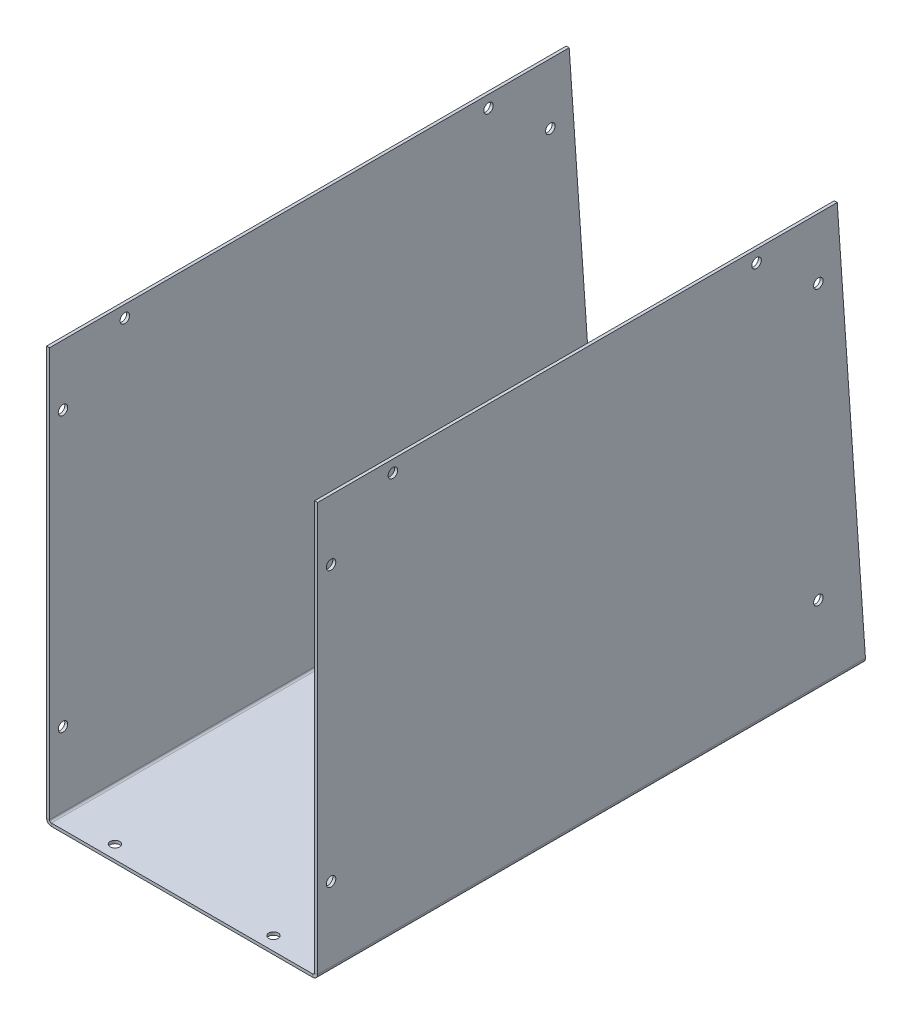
ISO-10303-21;
HEADER;
FILE_DESCRIPTION(('STEP AP214'),'2;1');
FILE_NAME('part.step','',(''),(''),'','','');
FILE_SCHEMA(('AUTOMOTIVE_DESIGN { 1 0 10303 214 1 1 1 1 }'));
ENDSEC;
DATA;
#1=APPLICATION_CONTEXT('core data for automotive mechanical design processes');
#2=APPLICATION_PROTOCOL_DEFINITION('international standard','automotive_design',2000,#1);
#3=PRODUCT_CONTEXT('',#1,'mechanical');
#4=PRODUCT('Part','Part','',(#3));
#5=PRODUCT_RELATED_PRODUCT_CATEGORY('part','',(#4));
#6=PRODUCT_DEFINITION_FORMATION('','',#4);
#7=PRODUCT_DEFINITION_CONTEXT('part definition',#1,'design');
#8=PRODUCT_DEFINITION('design','',#6,#7);
#9=PRODUCT_DEFINITION_SHAPE('','',#8);
#10=(LENGTH_UNIT() NAMED_UNIT(*) SI_UNIT(.MILLI.,.METRE.));
#11=(NAMED_UNIT(*) PLANE_ANGLE_UNIT() SI_UNIT($,.RADIAN.));
#12=(NAMED_UNIT(*) SI_UNIT($,.STERADIAN.) SOLID_ANGLE_UNIT());
#13=UNCERTAINTY_MEASURE_WITH_UNIT(LENGTH_MEASURE(1.E-05),#10,'distance_accuracy_value','');
#14=(GEOMETRIC_REPRESENTATION_CONTEXT(3) GLOBAL_UNCERTAINTY_ASSIGNED_CONTEXT((#13)) GLOBAL_UNIT_ASSIGNED_CONTEXT((#10,
#11,#12)) REPRESENTATION_CONTEXT('',''));
#15=CARTESIAN_POINT('',(0.,0.,0.));
#16=DIRECTION('',(0.,0.,1.));
#17=DIRECTION('',(1.,0.,0.));
#18=AXIS2_PLACEMENT_3D('',#15,#16,#17);
#19=CARTESIAN_POINT('',(-70.8025,0.,292.862));
#20=DIRECTION('',(-1.,0.,0.));
#21=DIRECTION('',(0.,0.,1.));
#22=AXIS2_PLACEMENT_3D('',#19,#20,#21);
#23=PLANE('',#22);
#24=CARTESIAN_POINT('',(-70.8025,42.0448840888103,25.3204999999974));
#25=DIRECTION('',(-1.,0.,0.));
#26=DIRECTION('',(0.,0.,1.));
#27=AXIS2_PLACEMENT_3D('',#24,#25,#26);
#28=CIRCLE('',#27,2.53999999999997);
#29=CARTESIAN_POINT('',(-70.8025,42.0448840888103,27.8604999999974));
#30=VERTEX_POINT('',#29);
#31=EDGE_CURVE('E214',#30,#30,#28,.T.);
#32=ORIENTED_EDGE('',*,*,#31,.T.);
#33=EDGE_LOOP('',(#32));
#34=FACE_BOUND('',#33,.T.);
#35=CARTESIAN_POINT('',(-70.8025,188.60288408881,25.3204999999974));
#36=DIRECTION('',(-1.,0.,0.));
#37=DIRECTION('',(0.,0.,1.));
#38=AXIS2_PLACEMENT_3D('',#35,#36,#37);
#39=CIRCLE('',#38,2.53999999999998);
#40=CARTESIAN_POINT('',(-70.8025,188.60288408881,27.8604999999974));
#41=VERTEX_POINT('',#40);
#42=EDGE_CURVE('E209',#41,#41,#39,.T.);
#43=ORIENTED_EDGE('',*,*,#42,.T.);
#44=EDGE_LOOP('',(#43));
#45=FACE_BOUND('',#44,.T.);
#46=CARTESIAN_POINT('',(-70.8025,214.566499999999,58.3562681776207));
#47=DIRECTION('',(-1.,0.,0.));
#48=DIRECTION('',(0.,0.,1.));
#49=AXIS2_PLACEMENT_3D('',#46,#47,#48);
#50=CIRCLE('',#49,2.53999999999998);
#51=CARTESIAN_POINT('',(-70.8025,214.566499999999,60.8962681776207));
#52=VERTEX_POINT('',#51);
#53=EDGE_CURVE('E204',#52,#52,#50,.T.);
#54=ORIENTED_EDGE('',*,*,#53,.T.);
#55=EDGE_LOOP('',(#54));
#56=FACE_BOUND('',#55,.T.);
#57=CARTESIAN_POINT('',(-70.8025,214.566499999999,252.634731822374));
#58=DIRECTION('',(-1.,0.,0.));
#59=DIRECTION('',(0.,0.,1.));
#60=AXIS2_PLACEMENT_3D('',#57,#58,#59);
#61=CIRCLE('',#60,2.54000000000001);
#62=CARTESIAN_POINT('',(-70.8025,214.566499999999,255.174731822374));
#63=VERTEX_POINT('',#62);
#64=EDGE_CURVE('E199',#63,#63,#61,.T.);
#65=ORIENTED_EDGE('',*,*,#64,.T.);
#66=EDGE_LOOP('',(#65));
#67=FACE_BOUND('',#66,.T.);
#68=CARTESIAN_POINT('',(-70.8025,188.60288408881,285.670499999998));
#69=DIRECTION('',(-1.,0.,0.));
#70=DIRECTION('',(0.,0.,1.));
#71=AXIS2_PLACEMENT_3D('',#68,#69,#70);
#72=CIRCLE('',#71,2.54000000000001);
#73=CARTESIAN_POINT('',(-70.8025,188.60288408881,288.210499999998));
#74=VERTEX_POINT('',#73);
#75=EDGE_CURVE('E194',#74,#74,#72,.T.);
#76=ORIENTED_EDGE('',*,*,#75,.T.);
#77=EDGE_LOOP('',(#76));
#78=FACE_BOUND('',#77,.T.);
#79=CARTESIAN_POINT('',(-70.8025,42.0448840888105,285.670499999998));
#80=DIRECTION('',(-1.,0.,0.));
#81=DIRECTION('',(0.,0.,1.));
#82=AXIS2_PLACEMENT_3D('',#79,#80,#81);
#83=CIRCLE('',#82,2.54);
#84=CARTESIAN_POINT('',(-70.8025,42.0448840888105,288.210499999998));
#85=VERTEX_POINT('',#84);
#86=EDGE_CURVE('E189',#85,#85,#83,.T.);
#87=ORIENTED_EDGE('',*,*,#86,.T.);
#88=EDGE_LOOP('',(#87));
#89=FACE_BOUND('',#88,.T.);
#90=DIRECTION('',(0.,0.997630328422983,0.0688020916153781));
#91=VECTOR('',#90,1.);
#92=CARTESIAN_POINT('',(-70.8025,20.1017704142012,1.38632899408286));
#93=LINE('',#92,#91);
#94=CARTESIAN_POINT('',(-70.8025,2.5875,0.178448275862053));
#95=VERTEX_POINT('',#94);
#96=CARTESIAN_POINT('',(-70.8025,220.98,15.24));
#97=VERTEX_POINT('',#96);
#98=EDGE_CURVE('E285',#95,#97,#93,.T.);
#99=ORIENTED_EDGE('',*,*,#98,.T.);
#100=DIRECTION('',(0.,0.,-1.));
#101=VECTOR('',#100,1.);
#102=CARTESIAN_POINT('',(-70.8025,220.98,292.862));
#103=LINE('',#102,#101);
#104=CARTESIAN_POINT('',(-70.8025,220.98,292.862));
#105=VERTEX_POINT('',#104);
#106=EDGE_CURVE('E179',#105,#97,#103,.T.);
#107=ORIENTED_EDGE('',*,*,#106,.F.);
#108=DIRECTION('',(0.,1.,0.));
#109=VECTOR('',#108,1.);
#110=CARTESIAN_POINT('',(-70.8025,0.,292.862));
#111=LINE('',#110,#109);
#112=CARTESIAN_POINT('',(-70.8025,2.5875,292.862));
#113=VERTEX_POINT('',#112);
#114=EDGE_CURVE('E305',#113,#105,#111,.T.);
#115=ORIENTED_EDGE('',*,*,#114,.F.);
#116=DIRECTION('',(0.,0.,-1.));
#117=VECTOR('',#116,1.);
#118=CARTESIAN_POINT('',(-70.8025,2.5875,292.862));
#119=LINE('',#118,#117);
#120=EDGE_CURVE('E338',#113,#95,#119,.T.);
#121=ORIENTED_EDGE('',*,*,#120,.T.);
#122=EDGE_LOOP('',(#99,#107,#115,#121));
#123=FACE_BOUND('',#122,.T.);
#124=ADVANCED_FACE('F37',(#34,#45,#56,#67,#78,#89,#123),#23,.F.);
#125=CARTESIAN_POINT('',(-72.39,220.98,292.862));
#126=DIRECTION('',(0.,1.,0.));
#127=DIRECTION('',(0.,0.,1.));
#128=AXIS2_PLACEMENT_3D('',#125,#126,#127);
#129=PLANE('',#128);
#130=ORIENTED_EDGE('',*,*,#106,.T.);
#131=DIRECTION('',(1.,0.,0.));
#132=VECTOR('',#131,1.);
#133=CARTESIAN_POINT('',(-70.8025,220.98,15.24));
#134=LINE('',#133,#132);
#135=CARTESIAN_POINT('',(-72.39,220.98,15.24));
#136=VERTEX_POINT('',#135);
#137=EDGE_CURVE('E292',#97,#136,#134,.F.);
#138=ORIENTED_EDGE('',*,*,#137,.T.);
#139=DIRECTION('',(0.,0.,-1.));
#140=VECTOR('',#139,1.);
#141=CARTESIAN_POINT('',(-72.39,220.98,292.862));
#142=LINE('',#141,#140);
#143=CARTESIAN_POINT('',(-72.39,220.98,292.862));
#144=VERTEX_POINT('',#143);
#145=EDGE_CURVE('E176',#144,#136,#142,.T.);
#146=ORIENTED_EDGE('',*,*,#145,.F.);
#147=DIRECTION('',(1.,0.,0.));
#148=VECTOR('',#147,1.);
#149=CARTESIAN_POINT('',(-72.39,220.98,292.862));
#150=LINE('',#149,#148);
#151=EDGE_CURVE('E309',#144,#105,#150,.T.);
#152=ORIENTED_EDGE('',*,*,#151,.T.);
#153=EDGE_LOOP('',(#130,#138,#146,#152));
#154=FACE_BOUND('',#153,.T.);
#155=ADVANCED_FACE('F388',(#154),#129,.T.);
#156=CARTESIAN_POINT('',(-72.39,0.,292.862));
#157=DIRECTION('',(-1.,0.,0.));
#158=DIRECTION('',(0.,0.,1.));
#159=AXIS2_PLACEMENT_3D('',#156,#157,#158);
#160=PLANE('',#159);
#161=CARTESIAN_POINT('',(-72.39,42.0448840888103,25.3204999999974));
#162=DIRECTION('',(1.,0.,0.));
#163=DIRECTION('',(0.,0.,-1.));
#164=AXIS2_PLACEMENT_3D('',#161,#162,#163);
#165=CIRCLE('',#164,2.53999999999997);
#166=CARTESIAN_POINT('',(-72.39,42.0448840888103,22.7804999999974));
#167=VERTEX_POINT('',#166);
#168=EDGE_CURVE('E215',#167,#167,#165,.T.);
#169=ORIENTED_EDGE('',*,*,#168,.T.);
#170=EDGE_LOOP('',(#169));
#171=FACE_BOUND('',#170,.T.);
#172=CARTESIAN_POINT('',(-72.39,188.60288408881,25.3204999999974));
#173=DIRECTION('',(1.,0.,0.));
#174=DIRECTION('',(0.,0.,-1.));
#175=AXIS2_PLACEMENT_3D('',#172,#173,#174);
#176=CIRCLE('',#175,2.53999999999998);
#177=CARTESIAN_POINT('',(-72.39,188.60288408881,22.7804999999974));
#178=VERTEX_POINT('',#177);
#179=EDGE_CURVE('E210',#178,#178,#176,.T.);
#180=ORIENTED_EDGE('',*,*,#179,.T.);
#181=EDGE_LOOP('',(#180));
#182=FACE_BOUND('',#181,.T.);
#183=CARTESIAN_POINT('',(-72.39,214.566499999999,58.3562681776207));
#184=DIRECTION('',(1.,0.,0.));
#185=DIRECTION('',(0.,0.,-1.));
#186=AXIS2_PLACEMENT_3D('',#183,#184,#185);
#187=CIRCLE('',#186,2.53999999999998);
#188=CARTESIAN_POINT('',(-72.39,214.566499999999,55.8162681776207));
#189=VERTEX_POINT('',#188);
#190=EDGE_CURVE('E205',#189,#189,#187,.T.);
#191=ORIENTED_EDGE('',*,*,#190,.T.);
#192=EDGE_LOOP('',(#191));
#193=FACE_BOUND('',#192,.T.);
#194=CARTESIAN_POINT('',(-72.39,214.566499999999,252.634731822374));
#195=DIRECTION('',(1.,0.,0.));
#196=DIRECTION('',(0.,0.,-1.));
#197=AXIS2_PLACEMENT_3D('',#194,#195,#196);
#198=CIRCLE('',#197,2.54000000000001);
#199=CARTESIAN_POINT('',(-72.39,214.566499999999,250.094731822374));
#200=VERTEX_POINT('',#199);
#201=EDGE_CURVE('E200',#200,#200,#198,.T.);
#202=ORIENTED_EDGE('',*,*,#201,.T.);
#203=EDGE_LOOP('',(#202));
#204=FACE_BOUND('',#203,.T.);
#205=CARTESIAN_POINT('',(-72.39,188.60288408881,285.670499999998));
#206=DIRECTION('',(1.,0.,0.));
#207=DIRECTION('',(0.,0.,-1.));
#208=AXIS2_PLACEMENT_3D('',#205,#206,#207);
#209=CIRCLE('',#208,2.54000000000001);
#210=CARTESIAN_POINT('',(-72.39,188.60288408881,283.130499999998));
#211=VERTEX_POINT('',#210);
#212=EDGE_CURVE('E195',#211,#211,#209,.T.);
#213=ORIENTED_EDGE('',*,*,#212,.T.);
#214=EDGE_LOOP('',(#213));
#215=FACE_BOUND('',#214,.T.);
#216=CARTESIAN_POINT('',(-72.39,42.0448840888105,285.670499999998));
#217=DIRECTION('',(1.,0.,0.));
#218=DIRECTION('',(0.,0.,-1.));
#219=AXIS2_PLACEMENT_3D('',#216,#217,#218);
#220=CIRCLE('',#219,2.54);
#221=CARTESIAN_POINT('',(-72.39,42.0448840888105,283.130499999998));
#222=VERTEX_POINT('',#221);
#223=EDGE_CURVE('E190',#222,#222,#220,.T.);
#224=ORIENTED_EDGE('',*,*,#223,.T.);
#225=EDGE_LOOP('',(#224));
#226=FACE_BOUND('',#225,.T.);
#227=ORIENTED_EDGE('',*,*,#145,.T.);
#228=DIRECTION('',(0.,0.997630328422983,0.0688020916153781));
#229=VECTOR('',#228,1.);
#230=CARTESIAN_POINT('',(-72.39,20.1017704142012,1.38632899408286));
#231=LINE('',#230,#229);
#232=CARTESIAN_POINT('',(-72.39,2.5875,0.178448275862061));
#233=VERTEX_POINT('',#232);
#234=EDGE_CURVE('E288',#233,#136,#231,.T.);
#235=ORIENTED_EDGE('',*,*,#234,.F.);
#236=DIRECTION('',(0.,0.,-1.));
#237=VECTOR('',#236,1.);
#238=CARTESIAN_POINT('',(-72.39,2.5875,292.862));
#239=LINE('',#238,#237);
#240=CARTESIAN_POINT('',(-72.39,2.5875,292.862));
#241=VERTEX_POINT('',#240);
#242=EDGE_CURVE('E168',#241,#233,#239,.T.);
#243=ORIENTED_EDGE('',*,*,#242,.F.);
#244=DIRECTION('',(0.,1.,0.));
#245=VECTOR('',#244,1.);
#246=CARTESIAN_POINT('',(-72.39,0.,292.862));
#247=LINE('',#246,#245);
#248=EDGE_CURVE('E312',#241,#144,#247,.T.);
#249=ORIENTED_EDGE('',*,*,#248,.T.);
#250=EDGE_LOOP('',(#227,#235,#243,#249));
#251=FACE_BOUND('',#250,.T.);
#252=ADVANCED_FACE('F382',(#171,#182,#193,#204,#215,#226,#251),#160,.T.);
#253=CARTESIAN_POINT('',(-69.8025,2.5875,292.862));
#254=DIRECTION('',(0.,0.,-1.));
#255=DIRECTION('',(-1.,0.,0.));
#256=AXIS2_PLACEMENT_3D('',#253,#254,#255);
#257=CYLINDRICAL_SURFACE('',#256,2.5875);
#258=ORIENTED_EDGE('',*,*,#242,.T.);
#259=CARTESIAN_POINT('',(-69.8025,2.5875,0.178448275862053));
#260=DIRECTION('',(0.,-0.0266438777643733,0.999644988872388));
#261=DIRECTION('',(0.,-0.999644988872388,-0.0266438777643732));
#262=AXIS2_PLACEMENT_3D('',#259,#260,#261);
#263=ELLIPSE('',#262,2.58841891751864,2.5875);
#264=CARTESIAN_POINT('',(-69.8025,0.,0.109482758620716));
#265=VERTEX_POINT('',#264);
#266=EDGE_CURVE('E283',#265,#233,#263,.F.);
#267=ORIENTED_EDGE('',*,*,#266,.F.);
#268=DIRECTION('',(0.,0.,-1.));
#269=VECTOR('',#268,1.);
#270=CARTESIAN_POINT('',(-69.8025,0.,292.862));
#271=LINE('',#270,#269);
#272=CARTESIAN_POINT('',(-69.8025,0.,292.862));
#273=VERTEX_POINT('',#272);
#274=EDGE_CURVE('E160',#273,#265,#271,.T.);
#275=ORIENTED_EDGE('',*,*,#274,.F.);
#276=CARTESIAN_POINT('',(-69.8025,2.5875,292.862));
#277=DIRECTION('',(0.,0.,1.));
#278=DIRECTION('',(1.,0.,0.));
#279=AXIS2_PLACEMENT_3D('',#276,#277,#278);
#280=CIRCLE('',#279,2.5875);
#281=EDGE_CURVE('E315',#273,#241,#280,.F.);
#282=ORIENTED_EDGE('',*,*,#281,.T.);
#283=EDGE_LOOP('',(#258,#267,#275,#282));
#284=FACE_BOUND('',#283,.T.);
#285=ADVANCED_FACE('F375',(#284),#257,.T.);
#286=CARTESIAN_POINT('',(-72.39,0.,292.862));
#287=DIRECTION('',(0.,-1.,0.));
#288=DIRECTION('',(1.,0.,0.));
#289=AXIS2_PLACEMENT_3D('',#286,#287,#288);
#290=PLANE('',#289);
#291=CARTESIAN_POINT('',(41.6481159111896,1.18672937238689E-13,285.670499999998));
#292=DIRECTION('',(0.,-1.,0.));
#293=DIRECTION('',(1.,0.,0.));
#294=AXIS2_PLACEMENT_3D('',#291,#292,#293);
#295=CIRCLE('',#294,2.53999999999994);
#296=CARTESIAN_POINT('',(44.1881159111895,1.19139527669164E-13,285.670499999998));
#297=VERTEX_POINT('',#296);
#298=EDGE_CURVE('E236',#297,#297,#295,.T.);
#299=ORIENTED_EDGE('',*,*,#298,.F.);
#300=EDGE_LOOP('',(#299));
#301=FACE_BOUND('',#300,.T.);
#302=CARTESIAN_POINT('',(-43.0451159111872,1.03115042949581E-13,285.670499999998));
#303=DIRECTION('',(0.,-1.,0.));
#304=DIRECTION('',(1.,0.,0.));
#305=AXIS2_PLACEMENT_3D('',#302,#303,#304);
#306=CIRCLE('',#305,2.53999999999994);
#307=CARTESIAN_POINT('',(-40.5051159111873,1.03581633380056E-13,285.670499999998));
#308=VERTEX_POINT('',#307);
#309=EDGE_CURVE('E226',#308,#308,#306,.T.);
#310=ORIENTED_EDGE('',*,*,#309,.F.);
#311=EDGE_LOOP('',(#310));
#312=FACE_BOUND('',#311,.T.);
#313=CARTESIAN_POINT('',(41.6481159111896,1.18672937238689E-13,25.3204999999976));
#314=DIRECTION('',(0.,-1.,0.));
#315=DIRECTION('',(1.,0.,0.));
#316=AXIS2_PLACEMENT_3D('',#313,#314,#315);
#317=CIRCLE('',#316,2.53999999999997);
#318=CARTESIAN_POINT('',(44.1881159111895,1.19139527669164E-13,25.3204999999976));
#319=VERTEX_POINT('',#318);
#320=EDGE_CURVE('E223',#319,#319,#317,.T.);
#321=ORIENTED_EDGE('',*,*,#320,.F.);
#322=EDGE_LOOP('',(#321));
#323=FACE_BOUND('',#322,.T.);
#324=CARTESIAN_POINT('',(-43.0451159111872,1.03115042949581E-13,25.3204999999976));
#325=DIRECTION('',(0.,-1.,0.));
#326=DIRECTION('',(1.,0.,0.));
#327=AXIS2_PLACEMENT_3D('',#324,#325,#326);
#328=CIRCLE('',#327,2.53999999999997);
#329=CARTESIAN_POINT('',(-40.5051159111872,1.03581633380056E-13,25.3204999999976));
#330=VERTEX_POINT('',#329);
#331=EDGE_CURVE('E220',#330,#330,#328,.T.);
#332=ORIENTED_EDGE('',*,*,#331,.F.);
#333=EDGE_LOOP('',(#332));
#334=FACE_BOUND('',#333,.T.);
#335=ORIENTED_EDGE('',*,*,#274,.T.);
#336=DIRECTION('',(1.,0.,0.));
#337=VECTOR('',#336,1.);
#338=CARTESIAN_POINT('',(-72.39,0.,0.10948275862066));
#339=LINE('',#338,#337);
#340=CARTESIAN_POINT('',(69.8025,0.,0.10948275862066));
#341=VERTEX_POINT('',#340);
#342=EDGE_CURVE('E146',#341,#265,#339,.F.);
#343=ORIENTED_EDGE('',*,*,#342,.F.);
#344=DIRECTION('',(0.,0.,-1.));
#345=VECTOR('',#344,1.);
#346=CARTESIAN_POINT('',(69.8025,0.,292.862));
#347=LINE('',#346,#345);
#348=CARTESIAN_POINT('',(69.8025,0.,292.862));
#349=VERTEX_POINT('',#348);
#350=EDGE_CURVE('E157',#349,#341,#347,.T.);
#351=ORIENTED_EDGE('',*,*,#350,.F.);
#352=DIRECTION('',(-1.,0.,0.));
#353=VECTOR('',#352,1.);
#354=CARTESIAN_POINT('',(-72.39,0.,292.862));
#355=LINE('',#354,#353);
#356=EDGE_CURVE('E318',#349,#273,#355,.T.);
#357=ORIENTED_EDGE('',*,*,#356,.T.);
#358=EDGE_LOOP('',(#335,#343,#351,#357));
#359=FACE_BOUND('',#358,.T.);
#360=ADVANCED_FACE('F155',(#301,#312,#323,#334,#359),#290,.T.);
#361=CARTESIAN_POINT('',(69.8025,2.58750000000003,292.862));
#362=DIRECTION('',(0.,0.,-1.));
#363=DIRECTION('',(-1.,0.,0.));
#364=AXIS2_PLACEMENT_3D('',#361,#362,#363);
#365=CYLINDRICAL_SURFACE('',#364,2.5875);
#366=ORIENTED_EDGE('',*,*,#350,.T.);
#367=CARTESIAN_POINT('',(69.8025,2.58750000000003,0.178448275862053));
#368=DIRECTION('',(0.,-0.0266438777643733,0.999644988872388));
#369=DIRECTION('',(0.,-0.999644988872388,-0.0266438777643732));
#370=AXIS2_PLACEMENT_3D('',#367,#368,#369);
#371=ELLIPSE('',#370,2.58841891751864,2.5875);
#372=CARTESIAN_POINT('',(72.39,2.58750000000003,0.178448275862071));
#373=VERTEX_POINT('',#372);
#374=EDGE_CURVE('E128',#373,#341,#371,.F.);
#375=ORIENTED_EDGE('',*,*,#374,.F.);
#376=DIRECTION('',(0.,0.,-1.));
#377=VECTOR('',#376,1.);
#378=CARTESIAN_POINT('',(72.39,2.58750000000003,292.862));
#379=LINE('',#378,#377);
#380=CARTESIAN_POINT('',(72.39,2.58750000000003,292.862));
#381=VERTEX_POINT('',#380);
#382=EDGE_CURVE('E166',#381,#373,#379,.T.);
#383=ORIENTED_EDGE('',*,*,#382,.F.);
#384=CARTESIAN_POINT('',(69.8025,2.58750000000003,292.862));
#385=DIRECTION('',(0.,0.,1.));
#386=DIRECTION('',(1.,0.,0.));
#387=AXIS2_PLACEMENT_3D('',#384,#385,#386);
#388=CIRCLE('',#387,2.5875);
#389=EDGE_CURVE('E165',#381,#349,#388,.F.);
#390=ORIENTED_EDGE('',*,*,#389,.T.);
#391=EDGE_LOOP('',(#366,#375,#383,#390));
#392=FACE_BOUND('',#391,.T.);
#393=ADVANCED_FACE('F163',(#392),#365,.T.);
#394=CARTESIAN_POINT('',(72.39,0.,292.862));
#395=DIRECTION('',(1.,0.,0.));
#396=DIRECTION('',(0.,0.,-1.));
#397=AXIS2_PLACEMENT_3D('',#394,#395,#396);
#398=PLANE('',#397);
#399=CARTESIAN_POINT('',(72.3900000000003,42.0448840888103,25.3204999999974));
#400=DIRECTION('',(1.,0.,0.));
#401=DIRECTION('',(0.,0.,-1.));
#402=AXIS2_PLACEMENT_3D('',#399,#400,#401);
#403=CIRCLE('',#402,2.53999999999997);
#404=CARTESIAN_POINT('',(72.3900000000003,42.0448840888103,22.7804999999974));
#405=VERTEX_POINT('',#404);
#406=EDGE_CURVE('E219',#405,#405,#403,.T.);
#407=ORIENTED_EDGE('',*,*,#406,.F.);
#408=EDGE_LOOP('',(#407));
#409=FACE_BOUND('',#408,.T.);
#410=CARTESIAN_POINT('',(72.3900000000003,188.60288408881,25.3204999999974));
#411=DIRECTION('',(1.,0.,0.));
#412=DIRECTION('',(0.,0.,-1.));
#413=AXIS2_PLACEMENT_3D('',#410,#411,#412);
#414=CIRCLE('',#413,2.53999999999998);
#415=CARTESIAN_POINT('',(72.3900000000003,188.60288408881,22.7804999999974));
#416=VERTEX_POINT('',#415);
#417=EDGE_CURVE('E247',#416,#416,#414,.T.);
#418=ORIENTED_EDGE('',*,*,#417,.F.);
#419=EDGE_LOOP('',(#418));
#420=FACE_BOUND('',#419,.T.);
#421=CARTESIAN_POINT('',(72.3900000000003,214.566499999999,58.3562681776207));
#422=DIRECTION('',(1.,0.,0.));
#423=DIRECTION('',(0.,0.,-1.));
#424=AXIS2_PLACEMENT_3D('',#421,#422,#423);
#425=CIRCLE('',#424,2.53999999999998);
#426=CARTESIAN_POINT('',(72.3900000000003,214.566499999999,55.8162681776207));
#427=VERTEX_POINT('',#426);
#428=EDGE_CURVE('E254',#427,#427,#425,.T.);
#429=ORIENTED_EDGE('',*,*,#428,.F.);
#430=EDGE_LOOP('',(#429));
#431=FACE_BOUND('',#430,.T.);
#432=CARTESIAN_POINT('',(72.3900000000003,214.566499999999,252.634731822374));
#433=DIRECTION('',(1.,0.,0.));
#434=DIRECTION('',(0.,0.,-1.));
#435=AXIS2_PLACEMENT_3D('',#432,#433,#434);
#436=CIRCLE('',#435,2.54000000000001);
#437=CARTESIAN_POINT('',(72.3900000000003,214.566499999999,250.094731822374));
#438=VERTEX_POINT('',#437);
#439=EDGE_CURVE('E261',#438,#438,#436,.T.);
#440=ORIENTED_EDGE('',*,*,#439,.F.);
#441=EDGE_LOOP('',(#440));
#442=FACE_BOUND('',#441,.T.);
#443=CARTESIAN_POINT('',(72.3900000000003,188.60288408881,285.670499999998));
#444=DIRECTION('',(1.,0.,0.));
#445=DIRECTION('',(0.,0.,-1.));
#446=AXIS2_PLACEMENT_3D('',#443,#444,#445);
#447=CIRCLE('',#446,2.54000000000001);
#448=CARTESIAN_POINT('',(72.3900000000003,188.60288408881,283.130499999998));
#449=VERTEX_POINT('',#448);
#450=EDGE_CURVE('E268',#449,#449,#447,.T.);
#451=ORIENTED_EDGE('',*,*,#450,.F.);
#452=EDGE_LOOP('',(#451));
#453=FACE_BOUND('',#452,.T.);
#454=CARTESIAN_POINT('',(72.3900000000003,42.0448840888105,285.670499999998));
#455=DIRECTION('',(1.,0.,0.));
#456=DIRECTION('',(0.,0.,-1.));
#457=AXIS2_PLACEMENT_3D('',#454,#455,#456);
#458=CIRCLE('',#457,2.54);
#459=CARTESIAN_POINT('',(72.3900000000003,42.0448840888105,283.130499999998));
#460=VERTEX_POINT('',#459);
#461=EDGE_CURVE('E275',#460,#460,#458,.T.);
#462=ORIENTED_EDGE('',*,*,#461,.F.);
#463=EDGE_LOOP('',(#462));
#464=FACE_BOUND('',#463,.T.);
#465=ORIENTED_EDGE('',*,*,#382,.T.);
#466=DIRECTION('',(0.,-0.997630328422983,-0.0688020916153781));
#467=VECTOR('',#466,1.);
#468=CARTESIAN_POINT('',(72.39,0.,0.));
#469=LINE('',#468,#467);
#470=CARTESIAN_POINT('',(72.39,220.98,15.24));
#471=VERTEX_POINT('',#470);
#472=EDGE_CURVE('E297',#471,#373,#469,.T.);
#473=ORIENTED_EDGE('',*,*,#472,.F.);
#474=DIRECTION('',(0.,0.,-1.));
#475=VECTOR('',#474,1.);
#476=CARTESIAN_POINT('',(72.39,220.98,292.862));
#477=LINE('',#476,#475);
#478=CARTESIAN_POINT('',(72.39,220.98,292.862));
#479=VERTEX_POINT('',#478);
#480=EDGE_CURVE('E170',#479,#471,#477,.T.);
#481=ORIENTED_EDGE('',*,*,#480,.F.);
#482=DIRECTION('',(0.,-1.,0.));
#483=VECTOR('',#482,1.);
#484=CARTESIAN_POINT('',(72.39,0.,292.862));
#485=LINE('',#484,#483);
#486=EDGE_CURVE('E321',#479,#381,#485,.T.);
#487=ORIENTED_EDGE('',*,*,#486,.T.);
#488=EDGE_LOOP('',(#465,#473,#481,#487));
#489=FACE_BOUND('',#488,.T.);
#490=ADVANCED_FACE('F359',(#409,#420,#431,#442,#453,#464,#489),#398,.T.);
#491=CARTESIAN_POINT('',(70.8025,220.98,292.862));
#492=DIRECTION('',(0.,1.,0.));
#493=DIRECTION('',(0.,0.,1.));
#494=AXIS2_PLACEMENT_3D('',#491,#492,#493);
#495=PLANE('',#494);
#496=ORIENTED_EDGE('',*,*,#480,.T.);
#497=DIRECTION('',(1.,0.,0.));
#498=VECTOR('',#497,1.);
#499=CARTESIAN_POINT('',(72.39,220.98,15.24));
#500=LINE('',#499,#498);
#501=CARTESIAN_POINT('',(70.8025,220.98,15.24));
#502=VERTEX_POINT('',#501);
#503=EDGE_CURVE('E302',#471,#502,#500,.F.);
#504=ORIENTED_EDGE('',*,*,#503,.T.);
#505=DIRECTION('',(0.,0.,-1.));
#506=VECTOR('',#505,1.);
#507=CARTESIAN_POINT('',(70.8025,220.98,292.862));
#508=LINE('',#507,#506);
#509=CARTESIAN_POINT('',(70.8025,220.98,292.862));
#510=VERTEX_POINT('',#509);
#511=EDGE_CURVE('E350',#510,#502,#508,.T.);
#512=ORIENTED_EDGE('',*,*,#511,.F.);
#513=DIRECTION('',(1.,0.,0.));
#514=VECTOR('',#513,1.);
#515=CARTESIAN_POINT('',(70.8025,220.98,292.862));
#516=LINE('',#515,#514);
#517=EDGE_CURVE('E324',#510,#479,#516,.T.);
#518=ORIENTED_EDGE('',*,*,#517,.T.);
#519=EDGE_LOOP('',(#496,#504,#512,#518));
#520=FACE_BOUND('',#519,.T.);
#521=ADVANCED_FACE('F354',(#520),#495,.T.);
#522=CARTESIAN_POINT('',(70.8025,0.,292.862));
#523=DIRECTION('',(1.,0.,0.));
#524=DIRECTION('',(0.,0.,-1.));
#525=AXIS2_PLACEMENT_3D('',#522,#523,#524);
#526=PLANE('',#525);
#527=CARTESIAN_POINT('',(70.8025,42.0448840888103,25.3204999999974));
#528=DIRECTION('',(1.,0.,0.));
#529=DIRECTION('',(0.,0.,-1.));
#530=AXIS2_PLACEMENT_3D('',#527,#528,#529);
#531=CIRCLE('',#530,2.53999999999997);
#532=CARTESIAN_POINT('',(70.8025,42.0448840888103,22.7804999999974));
#533=VERTEX_POINT('',#532);
#534=EDGE_CURVE('E211',#533,#533,#531,.T.);
#535=ORIENTED_EDGE('',*,*,#534,.T.);
#536=EDGE_LOOP('',(#535));
#537=FACE_BOUND('',#536,.T.);
#538=CARTESIAN_POINT('',(70.8025,188.60288408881,25.3204999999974));
#539=DIRECTION('',(1.,0.,0.));
#540=DIRECTION('',(0.,0.,-1.));
#541=AXIS2_PLACEMENT_3D('',#538,#539,#540);
#542=CIRCLE('',#541,2.53999999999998);
#543=CARTESIAN_POINT('',(70.8025,188.60288408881,22.7804999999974));
#544=VERTEX_POINT('',#543);
#545=EDGE_CURVE('E206',#544,#544,#542,.T.);
#546=ORIENTED_EDGE('',*,*,#545,.T.);
#547=EDGE_LOOP('',(#546));
#548=FACE_BOUND('',#547,.T.);
#549=CARTESIAN_POINT('',(70.8025,214.566499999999,58.3562681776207));
#550=DIRECTION('',(1.,0.,0.));
#551=DIRECTION('',(0.,0.,-1.));
#552=AXIS2_PLACEMENT_3D('',#549,#550,#551);
#553=CIRCLE('',#552,2.53999999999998);
#554=CARTESIAN_POINT('',(70.8025,214.566499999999,55.8162681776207));
#555=VERTEX_POINT('',#554);
#556=EDGE_CURVE('E201',#555,#555,#553,.T.);
#557=ORIENTED_EDGE('',*,*,#556,.T.);
#558=EDGE_LOOP('',(#557));
#559=FACE_BOUND('',#558,.T.);
#560=CARTESIAN_POINT('',(70.8025,214.566499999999,252.634731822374));
#561=DIRECTION('',(1.,0.,0.));
#562=DIRECTION('',(0.,0.,-1.));
#563=AXIS2_PLACEMENT_3D('',#560,#561,#562);
#564=CIRCLE('',#563,2.54000000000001);
#565=CARTESIAN_POINT('',(70.8025,214.566499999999,250.094731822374));
#566=VERTEX_POINT('',#565);
#567=EDGE_CURVE('E196',#566,#566,#564,.T.);
#568=ORIENTED_EDGE('',*,*,#567,.T.);
#569=EDGE_LOOP('',(#568));
#570=FACE_BOUND('',#569,.T.);
#571=CARTESIAN_POINT('',(70.8025,188.60288408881,285.670499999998));
#572=DIRECTION('',(1.,0.,0.));
#573=DIRECTION('',(0.,0.,-1.));
#574=AXIS2_PLACEMENT_3D('',#571,#572,#573);
#575=CIRCLE('',#574,2.54000000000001);
#576=CARTESIAN_POINT('',(70.8025,188.60288408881,283.130499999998));
#577=VERTEX_POINT('',#576);
#578=EDGE_CURVE('E191',#577,#577,#575,.T.);
#579=ORIENTED_EDGE('',*,*,#578,.T.);
#580=EDGE_LOOP('',(#579));
#581=FACE_BOUND('',#580,.T.);
#582=CARTESIAN_POINT('',(70.8025,42.0448840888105,285.670499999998));
#583=DIRECTION('',(1.,0.,0.));
#584=DIRECTION('',(0.,0.,-1.));
#585=AXIS2_PLACEMENT_3D('',#582,#583,#584);
#586=CIRCLE('',#585,2.54);
#587=CARTESIAN_POINT('',(70.8025,42.0448840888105,283.130499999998));
#588=VERTEX_POINT('',#587);
#589=EDGE_CURVE('E186',#588,#588,#586,.T.);
#590=ORIENTED_EDGE('',*,*,#589,.T.);
#591=EDGE_LOOP('',(#590));
#592=FACE_BOUND('',#591,.T.);
#593=DIRECTION('',(0.,-0.997630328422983,-0.0688020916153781));
#594=VECTOR('',#593,1.);
#595=CARTESIAN_POINT('',(70.8025,0.,0.));
#596=LINE('',#595,#594);
#597=CARTESIAN_POINT('',(70.8025,2.58750000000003,0.178448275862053));
#598=VERTEX_POINT('',#597);
#599=EDGE_CURVE('E299',#502,#598,#596,.T.);
#600=ORIENTED_EDGE('',*,*,#599,.T.);
#601=DIRECTION('',(0.,0.,-1.));
#602=VECTOR('',#601,1.);
#603=CARTESIAN_POINT('',(70.8025,2.58750000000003,292.862));
#604=LINE('',#603,#602);
#605=CARTESIAN_POINT('',(70.8025,2.58750000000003,292.862));
#606=VERTEX_POINT('',#605);
#607=EDGE_CURVE('E347',#606,#598,#604,.T.);
#608=ORIENTED_EDGE('',*,*,#607,.F.);
#609=DIRECTION('',(0.,1.,0.));
#610=VECTOR('',#609,1.);
#611=CARTESIAN_POINT('',(70.8025,0.,292.862));
#612=LINE('',#611,#610);
#613=EDGE_CURVE('E327',#510,#606,#612,.F.);
#614=ORIENTED_EDGE('',*,*,#613,.F.);
#615=ORIENTED_EDGE('',*,*,#511,.T.);
#616=EDGE_LOOP('',(#600,#608,#614,#615));
#617=FACE_BOUND('',#616,.T.);
#618=ADVANCED_FACE('F402',(#537,#548,#559,#570,#581,#592,#617),#526,.F.);
#619=CARTESIAN_POINT('',(69.8025,2.58750000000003,292.862));
#620=DIRECTION('',(0.,0.,-1.));
#621=DIRECTION('',(-1.,0.,0.));
#622=AXIS2_PLACEMENT_3D('',#619,#620,#621);
#623=CYLINDRICAL_SURFACE('',#622,1.);
#624=CARTESIAN_POINT('',(69.8025,2.58750000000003,0.178448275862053));
#625=DIRECTION('',(0.,-0.0688020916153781,0.997630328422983));
#626=DIRECTION('',(0.,-0.997630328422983,-0.0688020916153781));
#627=AXIS2_PLACEMENT_3D('',#624,#625,#626);
#628=ELLIPSE('',#627,1.00237530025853,1.);
#629=CARTESIAN_POINT('',(69.8025,1.58750000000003,0.109482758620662));
#630=VERTEX_POINT('',#629);
#631=EDGE_CURVE('E140',#598,#630,#628,.F.);
#632=ORIENTED_EDGE('',*,*,#631,.T.);
#633=DIRECTION('',(0.,0.,-1.));
#634=VECTOR('',#633,1.);
#635=CARTESIAN_POINT('',(69.8025,1.58750000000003,292.862));
#636=LINE('',#635,#634);
#637=CARTESIAN_POINT('',(69.8025,1.58750000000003,292.862));
#638=VERTEX_POINT('',#637);
#639=EDGE_CURVE('E344',#638,#630,#636,.T.);
#640=ORIENTED_EDGE('',*,*,#639,.F.);
#641=CARTESIAN_POINT('',(69.8025,2.58750000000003,292.862));
#642=DIRECTION('',(0.,0.,1.));
#643=DIRECTION('',(1.,0.,0.));
#644=AXIS2_PLACEMENT_3D('',#641,#642,#643);
#645=CIRCLE('',#644,1.);
#646=EDGE_CURVE('E330',#606,#638,#645,.F.);
#647=ORIENTED_EDGE('',*,*,#646,.F.);
#648=ORIENTED_EDGE('',*,*,#607,.T.);
#649=EDGE_LOOP('',(#632,#640,#647,#648));
#650=FACE_BOUND('',#649,.T.);
#651=ADVANCED_FACE('F398',(#650),#623,.F.);
#652=CARTESIAN_POINT('',(-72.39,1.5875,292.862));
#653=DIRECTION('',(0.,-1.,0.));
#654=DIRECTION('',(1.,0.,0.));
#655=AXIS2_PLACEMENT_3D('',#652,#653,#654);
#656=PLANE('',#655);
#657=CARTESIAN_POINT('',(41.6481159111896,1.58750000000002,285.670499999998));
#658=DIRECTION('',(0.,-1.,0.));
#659=DIRECTION('',(1.,0.,0.));
#660=AXIS2_PLACEMENT_3D('',#657,#658,#659);
#661=CIRCLE('',#660,2.53999999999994);
#662=CARTESIAN_POINT('',(44.1881159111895,1.58750000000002,285.670499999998));
#663=VERTEX_POINT('',#662);
#664=EDGE_CURVE('E41',#663,#663,#661,.T.);
#665=ORIENTED_EDGE('',*,*,#664,.T.);
#666=EDGE_LOOP('',(#665));
#667=FACE_BOUND('',#666,.T.);
#668=CARTESIAN_POINT('',(-43.0451159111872,1.58750000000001,285.670499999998));
#669=DIRECTION('',(0.,-1.,0.));
#670=DIRECTION('',(1.,0.,0.));
#671=AXIS2_PLACEMENT_3D('',#668,#669,#670);
#672=CIRCLE('',#671,2.53999999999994);
#673=CARTESIAN_POINT('',(-40.5051159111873,1.58750000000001,285.670499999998));
#674=VERTEX_POINT('',#673);
#675=EDGE_CURVE('E224',#674,#674,#672,.T.);
#676=ORIENTED_EDGE('',*,*,#675,.T.);
#677=EDGE_LOOP('',(#676));
#678=FACE_BOUND('',#677,.T.);
#679=CARTESIAN_POINT('',(41.6481159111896,1.58750000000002,25.3204999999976));
#680=DIRECTION('',(0.,-1.,0.));
#681=DIRECTION('',(1.,0.,0.));
#682=AXIS2_PLACEMENT_3D('',#679,#680,#681);
#683=CIRCLE('',#682,2.53999999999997);
#684=CARTESIAN_POINT('',(44.1881159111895,1.58750000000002,25.3204999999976));
#685=VERTEX_POINT('',#684);
#686=EDGE_CURVE('E221',#685,#685,#683,.T.);
#687=ORIENTED_EDGE('',*,*,#686,.T.);
#688=EDGE_LOOP('',(#687));
#689=FACE_BOUND('',#688,.T.);
#690=CARTESIAN_POINT('',(-43.0451159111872,1.58750000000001,25.3204999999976));
#691=DIRECTION('',(0.,-1.,0.));
#692=DIRECTION('',(1.,0.,0.));
#693=AXIS2_PLACEMENT_3D('',#690,#691,#692);
#694=CIRCLE('',#693,2.53999999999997);
#695=CARTESIAN_POINT('',(-40.5051159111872,1.58750000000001,25.3204999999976));
#696=VERTEX_POINT('',#695);
#697=EDGE_CURVE('E216',#696,#696,#694,.T.);
#698=ORIENTED_EDGE('',*,*,#697,.T.);
#699=EDGE_LOOP('',(#698));
#700=FACE_BOUND('',#699,.T.);
#701=DIRECTION('',(-1.,0.,0.));
#702=VECTOR('',#701,1.);
#703=CARTESIAN_POINT('',(-72.39,1.5875,0.10948275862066));
#704=LINE('',#703,#702);
#705=CARTESIAN_POINT('',(-69.8025,1.5875,0.109482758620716));
#706=VERTEX_POINT('',#705);
#707=EDGE_CURVE('E149',#630,#706,#704,.T.);
#708=ORIENTED_EDGE('',*,*,#707,.T.);
#709=DIRECTION('',(0.,0.,-1.));
#710=VECTOR('',#709,1.);
#711=CARTESIAN_POINT('',(-69.8025,1.5875,292.862));
#712=LINE('',#711,#710);
#713=CARTESIAN_POINT('',(-69.8025,1.5875,292.862));
#714=VERTEX_POINT('',#713);
#715=EDGE_CURVE('E341',#714,#706,#712,.T.);
#716=ORIENTED_EDGE('',*,*,#715,.F.);
#717=DIRECTION('',(-1.,0.,0.));
#718=VECTOR('',#717,1.);
#719=CARTESIAN_POINT('',(-72.39,1.5875,292.862));
#720=LINE('',#719,#718);
#721=EDGE_CURVE('E333',#638,#714,#720,.T.);
#722=ORIENTED_EDGE('',*,*,#721,.F.);
#723=ORIENTED_EDGE('',*,*,#639,.T.);
#724=EDGE_LOOP('',(#708,#716,#722,#723));
#725=FACE_BOUND('',#724,.T.);
#726=ADVANCED_FACE('F396',(#667,#678,#689,#700,#725),#656,.F.);
#727=CARTESIAN_POINT('',(-69.8025,2.5875,292.862));
#728=DIRECTION('',(0.,0.,-1.));
#729=DIRECTION('',(-1.,0.,0.));
#730=AXIS2_PLACEMENT_3D('',#727,#728,#729);
#731=CYLINDRICAL_SURFACE('',#730,1.);
#732=CARTESIAN_POINT('',(-69.8025,2.5875,0.178448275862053));
#733=DIRECTION('',(0.,-0.0688020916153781,0.997630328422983));
#734=DIRECTION('',(0.,-0.997630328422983,-0.0688020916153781));
#735=AXIS2_PLACEMENT_3D('',#732,#733,#734);
#736=ELLIPSE('',#735,1.00237530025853,1.);
#737=EDGE_CURVE('E139',#706,#95,#736,.F.);
#738=ORIENTED_EDGE('',*,*,#737,.T.);
#739=ORIENTED_EDGE('',*,*,#120,.F.);
#740=CARTESIAN_POINT('',(-69.8025,2.5875,292.862));
#741=DIRECTION('',(0.,0.,1.));
#742=DIRECTION('',(1.,0.,0.));
#743=AXIS2_PLACEMENT_3D('',#740,#741,#742);
#744=CIRCLE('',#743,1.);
#745=EDGE_CURVE('E336',#714,#113,#744,.F.);
#746=ORIENTED_EDGE('',*,*,#745,.F.);
#747=ORIENTED_EDGE('',*,*,#715,.T.);
#748=EDGE_LOOP('',(#738,#739,#746,#747));
#749=FACE_BOUND('',#748,.T.);
#750=ADVANCED_FACE('F393',(#749),#731,.F.);
#751=CARTESIAN_POINT('',(69.8025,0.,292.862));
#752=DIRECTION('',(0.,0.,1.));
#753=DIRECTION('',(1.,0.,0.));
#754=AXIS2_PLACEMENT_3D('',#751,#752,#753);
#755=PLANE('',#754);
#756=DIRECTION('',(0.,1.,0.));
#757=VECTOR('',#756,1.);
#758=CARTESIAN_POINT('',(69.8025,0.,292.862));
#759=LINE('',#758,#757);
#760=EDGE_CURVE('E11',#349,#638,#759,.T.);
#761=ORIENTED_EDGE('',*,*,#760,.F.);
#762=ORIENTED_EDGE('',*,*,#389,.F.);
#763=DIRECTION('',(1.,0.,0.));
#764=VECTOR('',#763,1.);
#765=CARTESIAN_POINT('',(70.8025,2.58750000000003,292.862));
#766=LINE('',#765,#764);
#767=EDGE_CURVE('E46',#606,#381,#766,.T.);
#768=ORIENTED_EDGE('',*,*,#767,.F.);
#769=ORIENTED_EDGE('',*,*,#646,.T.);
#770=EDGE_LOOP('',(#761,#762,#768,#769));
#771=FACE_BOUND('',#770,.T.);
#772=ADVANCED_FACE('F39',(#771),#755,.T.);
#773=CARTESIAN_POINT('',(70.8025,2.58750000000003,292.862));
#774=DIRECTION('',(0.,0.,1.));
#775=DIRECTION('',(1.,0.,0.));
#776=AXIS2_PLACEMENT_3D('',#773,#774,#775);
#777=PLANE('',#776);
#778=ORIENTED_EDGE('',*,*,#356,.F.);
#779=ORIENTED_EDGE('',*,*,#760,.T.);
#780=ORIENTED_EDGE('',*,*,#721,.T.);
#781=DIRECTION('',(0.,-1.,0.));
#782=VECTOR('',#781,1.);
#783=CARTESIAN_POINT('',(-69.8025,1.5875,292.862));
#784=LINE('',#783,#782);
#785=EDGE_CURVE('E182',#714,#273,#784,.T.);
#786=ORIENTED_EDGE('',*,*,#785,.T.);
#787=EDGE_LOOP('',(#778,#779,#780,#786));
#788=FACE_BOUND('',#787,.T.);
#789=ADVANCED_FACE('F368',(#788),#777,.T.);
#790=CARTESIAN_POINT('',(-72.39,2.5875,292.862));
#791=DIRECTION('',(0.,0.,1.));
#792=DIRECTION('',(1.,0.,0.));
#793=AXIS2_PLACEMENT_3D('',#790,#791,#792);
#794=PLANE('',#793);
#795=DIRECTION('',(1.,0.,0.));
#796=VECTOR('',#795,1.);
#797=CARTESIAN_POINT('',(-72.39,2.5875,292.862));
#798=LINE('',#797,#796);
#799=EDGE_CURVE('E62',#241,#113,#798,.T.);
#800=ORIENTED_EDGE('',*,*,#799,.F.);
#801=ORIENTED_EDGE('',*,*,#281,.F.);
#802=ORIENTED_EDGE('',*,*,#785,.F.);
#803=ORIENTED_EDGE('',*,*,#745,.T.);
#804=EDGE_LOOP('',(#800,#801,#802,#803));
#805=FACE_BOUND('',#804,.T.);
#806=ADVANCED_FACE('F376',(#805),#794,.T.);
#807=CARTESIAN_POINT('',(-69.8025,1.5875,292.862));
#808=DIRECTION('',(0.,0.,1.));
#809=DIRECTION('',(1.,0.,0.));
#810=AXIS2_PLACEMENT_3D('',#807,#808,#809);
#811=PLANE('',#810);
#812=ORIENTED_EDGE('',*,*,#248,.F.);
#813=ORIENTED_EDGE('',*,*,#799,.T.);
#814=ORIENTED_EDGE('',*,*,#114,.T.);
#815=ORIENTED_EDGE('',*,*,#151,.F.);
#816=EDGE_LOOP('',(#812,#813,#814,#815));
#817=FACE_BOUND('',#816,.T.);
#818=ADVANCED_FACE('F384',(#817),#811,.T.);
#819=CARTESIAN_POINT('',(-69.8025,2.5875,292.862));
#820=DIRECTION('',(0.,0.,1.));
#821=DIRECTION('',(1.,0.,0.));
#822=AXIS2_PLACEMENT_3D('',#819,#820,#821);
#823=PLANE('',#822);
#824=ORIENTED_EDGE('',*,*,#613,.T.);
#825=ORIENTED_EDGE('',*,*,#767,.T.);
#826=ORIENTED_EDGE('',*,*,#486,.F.);
#827=ORIENTED_EDGE('',*,*,#517,.F.);
#828=EDGE_LOOP('',(#824,#825,#826,#827));
#829=FACE_BOUND('',#828,.T.);
#830=ADVANCED_FACE('F361',(#829),#823,.T.);
#831=CARTESIAN_POINT('',(72.39,0.,0.));
#832=DIRECTION('',(0.,-0.0688020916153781,0.997630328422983));
#833=DIRECTION('',(0.,-0.997630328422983,-0.0688020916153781));
#834=AXIS2_PLACEMENT_3D('',#831,#832,#833);
#835=PLANE('',#834);
#836=ORIENTED_EDGE('',*,*,#472,.T.);
#837=DIRECTION('',(1.,0.,0.));
#838=VECTOR('',#837,1.);
#839=CARTESIAN_POINT('',(72.39,2.58750000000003,0.178448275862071));
#840=LINE('',#839,#838);
#841=EDGE_CURVE('E134',#373,#598,#840,.F.);
#842=ORIENTED_EDGE('',*,*,#841,.T.);
#843=ORIENTED_EDGE('',*,*,#599,.F.);
#844=ORIENTED_EDGE('',*,*,#503,.F.);
#845=EDGE_LOOP('',(#836,#842,#843,#844));
#846=FACE_BOUND('',#845,.T.);
#847=ADVANCED_FACE('F400',(#846),#835,.F.);
#848=CARTESIAN_POINT('',(-72.39,1.5875,0.10948275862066));
#849=DIRECTION('',(0.,0.,1.));
#850=DIRECTION('',(-1.,0.,0.));
#851=AXIS2_PLACEMENT_3D('',#848,#849,#850);
#852=PLANE('',#851);
#853=DIRECTION('',(0.,1.,0.));
#854=VECTOR('',#853,1.);
#855=CARTESIAN_POINT('',(-69.8025,1.5875,0.109482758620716));
#856=LINE('',#855,#854);
#857=EDGE_CURVE('E150',#706,#265,#856,.F.);
#858=ORIENTED_EDGE('',*,*,#857,.F.);
#859=ORIENTED_EDGE('',*,*,#707,.F.);
#860=DIRECTION('',(0.,1.,0.));
#861=VECTOR('',#860,1.);
#862=CARTESIAN_POINT('',(69.8025,1.58750000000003,0.109482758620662));
#863=LINE('',#862,#861);
#864=EDGE_CURVE('E131',#630,#341,#863,.F.);
#865=ORIENTED_EDGE('',*,*,#864,.T.);
#866=ORIENTED_EDGE('',*,*,#342,.T.);
#867=EDGE_LOOP('',(#858,#859,#865,#866));
#868=FACE_BOUND('',#867,.T.);
#869=ADVANCED_FACE('F145',(#868),#852,.F.);
#870=CARTESIAN_POINT('',(-70.8025,20.1017704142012,1.38632899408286));
#871=DIRECTION('',(0.,-0.0688020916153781,0.997630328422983));
#872=DIRECTION('',(0.,0.997630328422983,0.0688020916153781));
#873=AXIS2_PLACEMENT_3D('',#870,#871,#872);
#874=PLANE('',#873);
#875=ORIENTED_EDGE('',*,*,#137,.F.);
#876=ORIENTED_EDGE('',*,*,#98,.F.);
#877=DIRECTION('',(1.,0.,0.));
#878=VECTOR('',#877,1.);
#879=CARTESIAN_POINT('',(-70.8025,2.5875,0.178448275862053));
#880=LINE('',#879,#878);
#881=EDGE_CURVE('E54',#95,#233,#880,.F.);
#882=ORIENTED_EDGE('',*,*,#881,.T.);
#883=ORIENTED_EDGE('',*,*,#234,.T.);
#884=EDGE_LOOP('',(#875,#876,#882,#883));
#885=FACE_BOUND('',#884,.T.);
#886=ADVANCED_FACE('F390',(#885),#874,.F.);
#887=CARTESIAN_POINT('',(-69.8025,0.,0.109482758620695));
#888=CARTESIAN_POINT('',(-69.8025,0.529166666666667,0.109482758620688));
#889=CARTESIAN_POINT('',(-69.8025,1.05833333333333,0.109482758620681));
#890=CARTESIAN_POINT('',(-69.8025,1.5875,0.109482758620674));
#891=CARTESIAN_POINT('',(-74.9775,0.,0.109482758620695));
#892=CARTESIAN_POINT('',(-73.9191666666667,0.529166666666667,0.109482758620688));
#893=CARTESIAN_POINT('',(-72.8608333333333,1.05833333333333,0.109482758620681));
#894=CARTESIAN_POINT('',(-71.8025,1.5875,0.109482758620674));
#895=CARTESIAN_POINT('',(-74.9775,5.175,0.247413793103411));
#896=CARTESIAN_POINT('',(-73.9191666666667,4.64583333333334,0.247413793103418));
#897=CARTESIAN_POINT('',(-72.8608333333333,4.11666666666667,0.247413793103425));
#898=CARTESIAN_POINT('',(-71.8025,3.5875,0.247413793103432));
#899=CARTESIAN_POINT('',(-69.8025,5.175,0.247413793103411));
#900=CARTESIAN_POINT('',(-69.8025,4.64583333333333,0.247413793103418));
#901=CARTESIAN_POINT('',(-69.8025,4.11666666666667,0.247413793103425));
#902=CARTESIAN_POINT('',(-69.8025,3.5875,0.247413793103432));
#903=CARTESIAN_POINT('',(-64.6275,5.175,0.247413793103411));
#904=CARTESIAN_POINT('',(-65.6858333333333,4.64583333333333,0.247413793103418));
#905=CARTESIAN_POINT('',(-66.7441666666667,4.11666666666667,0.247413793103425));
#906=CARTESIAN_POINT('',(-67.8025,3.5875,0.247413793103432));
#907=CARTESIAN_POINT('',(-64.6275,0.,0.109482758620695));
#908=CARTESIAN_POINT('',(-65.6858333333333,0.529166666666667,0.109482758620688));
#909=CARTESIAN_POINT('',(-66.7441666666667,1.05833333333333,0.109482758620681));
#910=CARTESIAN_POINT('',(-67.8025,1.5875,0.109482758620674));
#911=CARTESIAN_POINT('',(-69.8025,0.,0.109482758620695));
#912=CARTESIAN_POINT('',(-69.8025,0.529166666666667,0.109482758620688));
#913=CARTESIAN_POINT('',(-69.8025,1.05833333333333,0.109482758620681));
#914=CARTESIAN_POINT('',(-69.8025,1.5875,0.109482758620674));
#915=(BOUNDED_SURFACE() B_SPLINE_SURFACE(3,3,((#887,#888,#889,#890),(#891,#892,#893,#894),(#895,
#896,#897,#898),(#899,#900,#901,#902),(#903,#904,#905,#906),(#907,#908,#909,#910),(#911,#912,
#913,#914)),.UNSPECIFIED.,.T.,.F.,.F.) B_SPLINE_SURFACE_WITH_KNOTS((4,3,4),(4,4),(0.,0.5,1.),
(0.,1.),.UNSPECIFIED.) GEOMETRIC_REPRESENTATION_ITEM() RATIONAL_B_SPLINE_SURFACE(((1.,1.,1.,1.),
(0.333333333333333,0.333333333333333,0.333333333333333,0.333333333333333),(0.333333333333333,
0.333333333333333,0.333333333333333,0.333333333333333),(1.,1.,1.,1.),(0.333333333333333,
0.333333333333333,0.333333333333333,0.333333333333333),(0.333333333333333,0.333333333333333,
0.333333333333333,0.333333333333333),(1.,1.,1.,1.))) REPRESENTATION_ITEM('') SURFACE());
#916=ORIENTED_EDGE('',*,*,#881,.F.);
#917=ORIENTED_EDGE('',*,*,#737,.F.);
#918=ORIENTED_EDGE('',*,*,#857,.T.);
#919=ORIENTED_EDGE('',*,*,#266,.T.);
#920=EDGE_LOOP('',(#916,#917,#918,#919));
#921=FACE_BOUND('',#920,.T.);
#922=ADVANCED_FACE('F394',(#921),#915,.T.);
#923=CARTESIAN_POINT('',(69.8025,0.,0.109482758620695));
#924=CARTESIAN_POINT('',(69.8025,0.529166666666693,0.109482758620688));
#925=CARTESIAN_POINT('',(69.8025,1.05833333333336,0.109482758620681));
#926=CARTESIAN_POINT('',(69.8025,1.58750000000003,0.109482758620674));
#927=CARTESIAN_POINT('',(64.6275,0.,0.109482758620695));
#928=CARTESIAN_POINT('',(65.6858333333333,0.529166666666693,0.109482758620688));
#929=CARTESIAN_POINT('',(66.7441666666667,1.05833333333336,0.109482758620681));
#930=CARTESIAN_POINT('',(67.8025,1.58750000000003,0.109482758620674));
#931=CARTESIAN_POINT('',(64.6275,5.17500000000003,0.247413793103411));
#932=CARTESIAN_POINT('',(65.6858333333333,4.64583333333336,0.247413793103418));
#933=CARTESIAN_POINT('',(66.7441666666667,4.11666666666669,0.247413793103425));
#934=CARTESIAN_POINT('',(67.8025,3.58750000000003,0.247413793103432));
#935=CARTESIAN_POINT('',(69.8025,5.17500000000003,0.247413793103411));
#936=CARTESIAN_POINT('',(69.8025,4.64583333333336,0.247413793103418));
#937=CARTESIAN_POINT('',(69.8025,4.11666666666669,0.247413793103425));
#938=CARTESIAN_POINT('',(69.8025,3.58750000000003,0.247413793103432));
#939=CARTESIAN_POINT('',(74.9775,5.17500000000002,0.247413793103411));
#940=CARTESIAN_POINT('',(73.9191666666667,4.64583333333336,0.247413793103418));
#941=CARTESIAN_POINT('',(72.8608333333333,4.11666666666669,0.247413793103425));
#942=CARTESIAN_POINT('',(71.8025,3.58750000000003,0.247413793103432));
#943=CARTESIAN_POINT('',(74.9775,0.,0.109482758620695));
#944=CARTESIAN_POINT('',(73.9191666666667,0.529166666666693,0.109482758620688));
#945=CARTESIAN_POINT('',(72.8608333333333,1.05833333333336,0.109482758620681));
#946=CARTESIAN_POINT('',(71.8025,1.58750000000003,0.109482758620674));
#947=CARTESIAN_POINT('',(69.8025,0.,0.109482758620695));
#948=CARTESIAN_POINT('',(69.8025,0.529166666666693,0.109482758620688));
#949=CARTESIAN_POINT('',(69.8025,1.05833333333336,0.109482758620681));
#950=CARTESIAN_POINT('',(69.8025,1.58750000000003,0.109482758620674));
#951=(BOUNDED_SURFACE() B_SPLINE_SURFACE(3,3,((#923,#924,#925,#926),(#927,#928,#929,#930),(#931,
#932,#933,#934),(#935,#936,#937,#938),(#939,#940,#941,#942),(#943,#944,#945,#946),(#947,#948,
#949,#950)),.UNSPECIFIED.,.T.,.F.,.F.) B_SPLINE_SURFACE_WITH_KNOTS((4,3,4),(4,4),(0.,0.5,1.),
(0.,1.),.UNSPECIFIED.) GEOMETRIC_REPRESENTATION_ITEM() RATIONAL_B_SPLINE_SURFACE(((1.,1.,1.,1.),
(0.333333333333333,0.333333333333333,0.333333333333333,0.333333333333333),(0.333333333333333,
0.333333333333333,0.333333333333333,0.333333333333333),(1.,1.,1.,1.),(0.333333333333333,
0.333333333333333,0.333333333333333,0.333333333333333),(0.333333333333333,0.333333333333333,
0.333333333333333,0.333333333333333),(1.,1.,1.,1.))) REPRESENTATION_ITEM('') SURFACE());
#952=ORIENTED_EDGE('',*,*,#864,.F.);
#953=ORIENTED_EDGE('',*,*,#631,.F.);
#954=ORIENTED_EDGE('',*,*,#841,.F.);
#955=ORIENTED_EDGE('',*,*,#374,.T.);
#956=EDGE_LOOP('',(#952,#953,#954,#955));
#957=FACE_BOUND('',#956,.T.);
#958=ADVANCED_FACE('F130',(#957),#951,.T.);
#959=CARTESIAN_POINT('',(-72.39,42.0448840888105,285.670499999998));
#960=DIRECTION('',(1.,0.,0.));
#961=DIRECTION('',(0.,0.,-1.));
#962=AXIS2_PLACEMENT_3D('',#959,#960,#961);
#963=CYLINDRICAL_SURFACE('',#962,2.54);
#964=ORIENTED_EDGE('',*,*,#461,.T.);
#965=EDGE_LOOP('',(#964));
#966=FACE_BOUND('',#965,.T.);
#967=ORIENTED_EDGE('',*,*,#589,.F.);
#968=EDGE_LOOP('',(#967));
#969=FACE_BOUND('',#968,.T.);
#970=ADVANCED_FACE('F466',(#966,#969),#963,.F.);
#971=ORIENTED_EDGE('',*,*,#223,.F.);
#972=EDGE_LOOP('',(#971));
#973=FACE_BOUND('',#972,.T.);
#974=ORIENTED_EDGE('',*,*,#86,.F.);
#975=EDGE_LOOP('',(#974));
#976=FACE_BOUND('',#975,.T.);
#977=ADVANCED_FACE('F467',(#973,#976),#963,.F.);
#978=CARTESIAN_POINT('',(-72.39,188.60288408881,285.670499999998));
#979=DIRECTION('',(1.,0.,0.));
#980=DIRECTION('',(0.,0.,-1.));
#981=AXIS2_PLACEMENT_3D('',#978,#979,#980);
#982=CYLINDRICAL_SURFACE('',#981,2.54000000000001);
#983=ORIENTED_EDGE('',*,*,#450,.T.);
#984=EDGE_LOOP('',(#983));
#985=FACE_BOUND('',#984,.T.);
#986=ORIENTED_EDGE('',*,*,#578,.F.);
#987=EDGE_LOOP('',(#986));
#988=FACE_BOUND('',#987,.T.);
#989=ADVANCED_FACE('F475',(#985,#988),#982,.F.);
#990=ORIENTED_EDGE('',*,*,#212,.F.);
#991=EDGE_LOOP('',(#990));
#992=FACE_BOUND('',#991,.T.);
#993=ORIENTED_EDGE('',*,*,#75,.F.);
#994=EDGE_LOOP('',(#993));
#995=FACE_BOUND('',#994,.T.);
#996=ADVANCED_FACE('F477',(#992,#995),#982,.F.);
#997=CARTESIAN_POINT('',(-72.39,214.566499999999,252.634731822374));
#998=DIRECTION('',(1.,0.,0.));
#999=DIRECTION('',(0.,0.,-1.));
#1000=AXIS2_PLACEMENT_3D('',#997,#998,#999);
#1001=CYLINDRICAL_SURFACE('',#1000,2.54000000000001);
#1002=ORIENTED_EDGE('',*,*,#439,.T.);
#1003=EDGE_LOOP('',(#1002));
#1004=FACE_BOUND('',#1003,.T.);
#1005=ORIENTED_EDGE('',*,*,#567,.F.);
#1006=EDGE_LOOP('',(#1005));
#1007=FACE_BOUND('',#1006,.T.);
#1008=ADVANCED_FACE('F480',(#1004,#1007),#1001,.F.);
#1009=ORIENTED_EDGE('',*,*,#201,.F.);
#1010=EDGE_LOOP('',(#1009));
#1011=FACE_BOUND('',#1010,.T.);
#1012=ORIENTED_EDGE('',*,*,#64,.F.);
#1013=EDGE_LOOP('',(#1012));
#1014=FACE_BOUND('',#1013,.T.);
#1015=ADVANCED_FACE('F482',(#1011,#1014),#1001,.F.);
#1016=CARTESIAN_POINT('',(-72.39,214.566499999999,58.3562681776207));
#1017=DIRECTION('',(1.,0.,0.));
#1018=DIRECTION('',(0.,0.,-1.));
#1019=AXIS2_PLACEMENT_3D('',#1016,#1017,#1018);
#1020=CYLINDRICAL_SURFACE('',#1019,2.53999999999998);
#1021=ORIENTED_EDGE('',*,*,#428,.T.);
#1022=EDGE_LOOP('',(#1021));
#1023=FACE_BOUND('',#1022,.T.);
#1024=ORIENTED_EDGE('',*,*,#556,.F.);
#1025=EDGE_LOOP('',(#1024));
#1026=FACE_BOUND('',#1025,.T.);
#1027=ADVANCED_FACE('F485',(#1023,#1026),#1020,.F.);
#1028=ORIENTED_EDGE('',*,*,#190,.F.);
#1029=EDGE_LOOP('',(#1028));
#1030=FACE_BOUND('',#1029,.T.);
#1031=ORIENTED_EDGE('',*,*,#53,.F.);
#1032=EDGE_LOOP('',(#1031));
#1033=FACE_BOUND('',#1032,.T.);
#1034=ADVANCED_FACE('F487',(#1030,#1033),#1020,.F.);
#1035=CARTESIAN_POINT('',(-72.39,188.60288408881,25.3204999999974));
#1036=DIRECTION('',(1.,0.,0.));
#1037=DIRECTION('',(0.,0.,-1.));
#1038=AXIS2_PLACEMENT_3D('',#1035,#1036,#1037);
#1039=CYLINDRICAL_SURFACE('',#1038,2.53999999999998);
#1040=ORIENTED_EDGE('',*,*,#417,.T.);
#1041=EDGE_LOOP('',(#1040));
#1042=FACE_BOUND('',#1041,.T.);
#1043=ORIENTED_EDGE('',*,*,#545,.F.);
#1044=EDGE_LOOP('',(#1043));
#1045=FACE_BOUND('',#1044,.T.);
#1046=ADVANCED_FACE('F490',(#1042,#1045),#1039,.F.);
#1047=ORIENTED_EDGE('',*,*,#179,.F.);
#1048=EDGE_LOOP('',(#1047));
#1049=FACE_BOUND('',#1048,.T.);
#1050=ORIENTED_EDGE('',*,*,#42,.F.);
#1051=EDGE_LOOP('',(#1050));
#1052=FACE_BOUND('',#1051,.T.);
#1053=ADVANCED_FACE('F492',(#1049,#1052),#1039,.F.);
#1054=CARTESIAN_POINT('',(-72.39,42.0448840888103,25.3204999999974));
#1055=DIRECTION('',(1.,0.,0.));
#1056=DIRECTION('',(0.,0.,-1.));
#1057=AXIS2_PLACEMENT_3D('',#1054,#1055,#1056);
#1058=CYLINDRICAL_SURFACE('',#1057,2.53999999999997);
#1059=ORIENTED_EDGE('',*,*,#406,.T.);
#1060=EDGE_LOOP('',(#1059));
#1061=FACE_BOUND('',#1060,.T.);
#1062=ORIENTED_EDGE('',*,*,#534,.F.);
#1063=EDGE_LOOP('',(#1062));
#1064=FACE_BOUND('',#1063,.T.);
#1065=ADVANCED_FACE('F495',(#1061,#1064),#1058,.F.);
#1066=ORIENTED_EDGE('',*,*,#168,.F.);
#1067=EDGE_LOOP('',(#1066));
#1068=FACE_BOUND('',#1067,.T.);
#1069=ORIENTED_EDGE('',*,*,#31,.F.);
#1070=EDGE_LOOP('',(#1069));
#1071=FACE_BOUND('',#1070,.T.);
#1072=ADVANCED_FACE('F497',(#1068,#1071),#1058,.F.);
#1073=CARTESIAN_POINT('',(-43.0451159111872,12.7000000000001,25.3204999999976));
#1074=DIRECTION('',(0.,-1.,0.));
#1075=DIRECTION('',(1.,0.,0.));
#1076=AXIS2_PLACEMENT_3D('',#1073,#1074,#1075);
#1077=CYLINDRICAL_SURFACE('',#1076,2.53999999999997);
#1078=ORIENTED_EDGE('',*,*,#331,.T.);
#1079=EDGE_LOOP('',(#1078));
#1080=FACE_BOUND('',#1079,.T.);
#1081=ORIENTED_EDGE('',*,*,#697,.F.);
#1082=EDGE_LOOP('',(#1081));
#1083=FACE_BOUND('',#1082,.T.);
#1084=ADVANCED_FACE('F500',(#1080,#1083),#1077,.F.);
#1085=CARTESIAN_POINT('',(41.6481159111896,12.7000000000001,25.3204999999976));
#1086=DIRECTION('',(0.,-1.,0.));
#1087=DIRECTION('',(1.,0.,0.));
#1088=AXIS2_PLACEMENT_3D('',#1085,#1086,#1087);
#1089=CYLINDRICAL_SURFACE('',#1088,2.53999999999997);
#1090=ORIENTED_EDGE('',*,*,#320,.T.);
#1091=EDGE_LOOP('',(#1090));
#1092=FACE_BOUND('',#1091,.T.);
#1093=ORIENTED_EDGE('',*,*,#686,.F.);
#1094=EDGE_LOOP('',(#1093));
#1095=FACE_BOUND('',#1094,.T.);
#1096=ADVANCED_FACE('F504',(#1092,#1095),#1089,.F.);
#1097=CARTESIAN_POINT('',(-43.0451159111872,12.7000000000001,285.670499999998));
#1098=DIRECTION('',(0.,-1.,0.));
#1099=DIRECTION('',(1.,0.,0.));
#1100=AXIS2_PLACEMENT_3D('',#1097,#1098,#1099);
#1101=CYLINDRICAL_SURFACE('',#1100,2.53999999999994);
#1102=ORIENTED_EDGE('',*,*,#309,.T.);
#1103=EDGE_LOOP('',(#1102));
#1104=FACE_BOUND('',#1103,.T.);
#1105=ORIENTED_EDGE('',*,*,#675,.F.);
#1106=EDGE_LOOP('',(#1105));
#1107=FACE_BOUND('',#1106,.T.);
#1108=ADVANCED_FACE('F508',(#1104,#1107),#1101,.F.);
#1109=CARTESIAN_POINT('',(41.6481159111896,12.7000000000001,285.670499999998));
#1110=DIRECTION('',(0.,-1.,0.));
#1111=DIRECTION('',(1.,0.,0.));
#1112=AXIS2_PLACEMENT_3D('',#1109,#1110,#1111);
#1113=CYLINDRICAL_SURFACE('',#1112,2.53999999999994);
#1114=ORIENTED_EDGE('',*,*,#298,.T.);
#1115=EDGE_LOOP('',(#1114));
#1116=FACE_BOUND('',#1115,.T.);
#1117=ORIENTED_EDGE('',*,*,#664,.F.);
#1118=EDGE_LOOP('',(#1117));
#1119=FACE_BOUND('',#1118,.T.);
#1120=ADVANCED_FACE('F512',(#1116,#1119),#1113,.F.);
#1121=CLOSED_SHELL('',(#124,#155,#252,#285,#360,#393,#490,#521,#618,#651,#726,#750,#772,#789,
#806,#818,#830,#847,#869,#886,#922,#958,#970,#977,#989,#996,#1008,#1015,#1027,#1034,#1046,#1053,
#1065,#1072,#1084,#1096,#1108,#1120));
#1122=MANIFOLD_SOLID_BREP('B2',#1121);
#1123=ADVANCED_BREP_SHAPE_REPRESENTATION('',(#18,#1122),#14);
#1124=SHAPE_DEFINITION_REPRESENTATION(#9,#1123);
ENDSEC;
END-ISO-10303-21;
